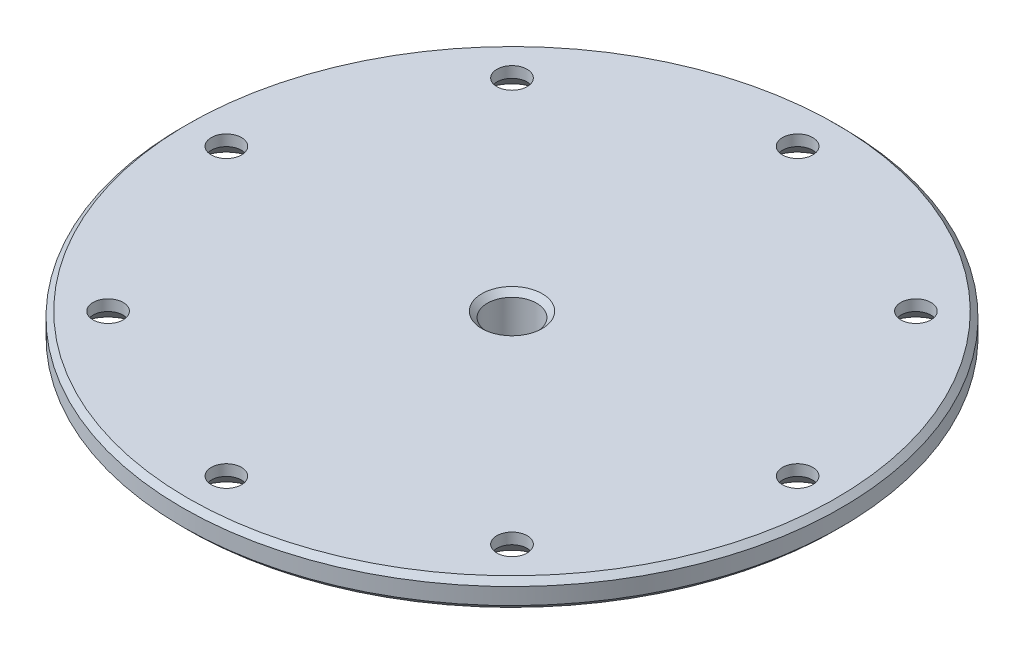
from build123d import *

# Parameters (mm, degrees)
CHANFREIN2_SIZE              = 1
ESQUISSE2_R                  = 4.5
ENL_V_MAT_EXTRU_1_DEPTH      = 87.34813258
ESQUISSE3_R                  = 2.75
ENL_V_MAT_EXTRU_2_DEPTH      = 87.34813258
R_P_TITION_CIRCULAIRE1_COUNT = 8
CHANFREIN4_SIZE              = 3
CHANFREIN5_SIZE              = 1
CHANFREIN6_SIZE              = 1


with BuildPart() as part:
    # Esquisse1 → R_volution1 (revolve)
    with BuildSketch(Plane.XY, mode=Mode.PRIVATE) as r_volution1_sk:
        Polygon((0, 0), (15, 0), (15, 6), (22, 6), (22, 11), (60, 11), (60, 16), (0, 16), align=None)
    revolve(r_volution1_sk.sketch.rotate(Axis((0, 0, 0), (0, 1, 0)), 90), axis=Axis((0, 0, 0), (0, 1, 0)))

    # Chanfrein2
    chanfrein2_edges = [part.edges().sort_by_distance(p)[0] for p in [
        (0, 16, 60),
        (0, 11, 60),
        (0, 6, 22),
        (0, 0, 15),
    ]]
    chamfer(chanfrein2_edges, length=CHANFREIN2_SIZE)

    # Esquisse2 → Enl_v. mat.-Extru.1 (cut, through all)
    with BuildSketch(Plane(origin=(0, 16, 0), x_dir=(1, 0, 0), z_dir=(0, 1, 0))):
        with Locations(Location((0, 0, 0), (0, 0, 270))):
            Circle(ESQUISSE2_R)
    extrude(amount=-ENL_V_MAT_EXTRU_1_DEPTH, mode=Mode.SUBTRACT)

    # Esquisse3 → Enl_v. mat.-Extru.2 (cut, through all)
    with BuildSketch(Plane(origin=(0, 16, 0), x_dir=(1, 0, 0), z_dir=(0, 1, 0))):
        with Locations(Location((0, 52, 0), (0, 0, 270))):
            Circle(ESQUISSE3_R)
    enl_v_mat_extru_2 = extrude(amount=-ENL_V_MAT_EXTRU_2_DEPTH, mode=Mode.SUBTRACT)

    # R_p_tition circulaire1: Enl_v. mat.-Extru.2 ×8 about axis
    r_p_tition_circulaire1_axis = Axis((0, 0, 0), (0, 1, 0))
    for i in range(1, R_P_TITION_CIRCULAIRE1_COUNT):
        add(enl_v_mat_extru_2.rotate(r_p_tition_circulaire1_axis, i * 360 / R_P_TITION_CIRCULAIRE1_COUNT), mode=Mode.SUBTRACT)

    # Chanfrein4
    chanfrein4_edges = [part.edges().sort_by_distance(p)[0] for p in [
        (0, 11, -54.75),
        (-38.71409627, 11, -38.71409627),
        (-54.75, 11, 0),
        (-38.71409627, 11, 38.71409627),
        (0, 11, 54.75),
        (38.71409627, 11, 38.71409627),
        (54.75, 11, 0),
        (38.71409627, 11, -38.71409627),
    ]]
    chamfer(chanfrein4_edges, length=CHANFREIN4_SIZE)

    # Chanfrein5
    chanfrein5_edges = [part.edges().sort_by_distance(p)[0] for p in [
        (0, 16, -4.5),
    ]]
    chamfer(chanfrein5_edges, length=CHANFREIN5_SIZE)

    # Chanfrein6
    chanfrein6_edges = [part.edges().sort_by_distance(p)[0] for p in [
        (0, 0, -4.5),
    ]]
    chamfer(chanfrein6_edges, length=CHANFREIN6_SIZE)


solid = part.part
